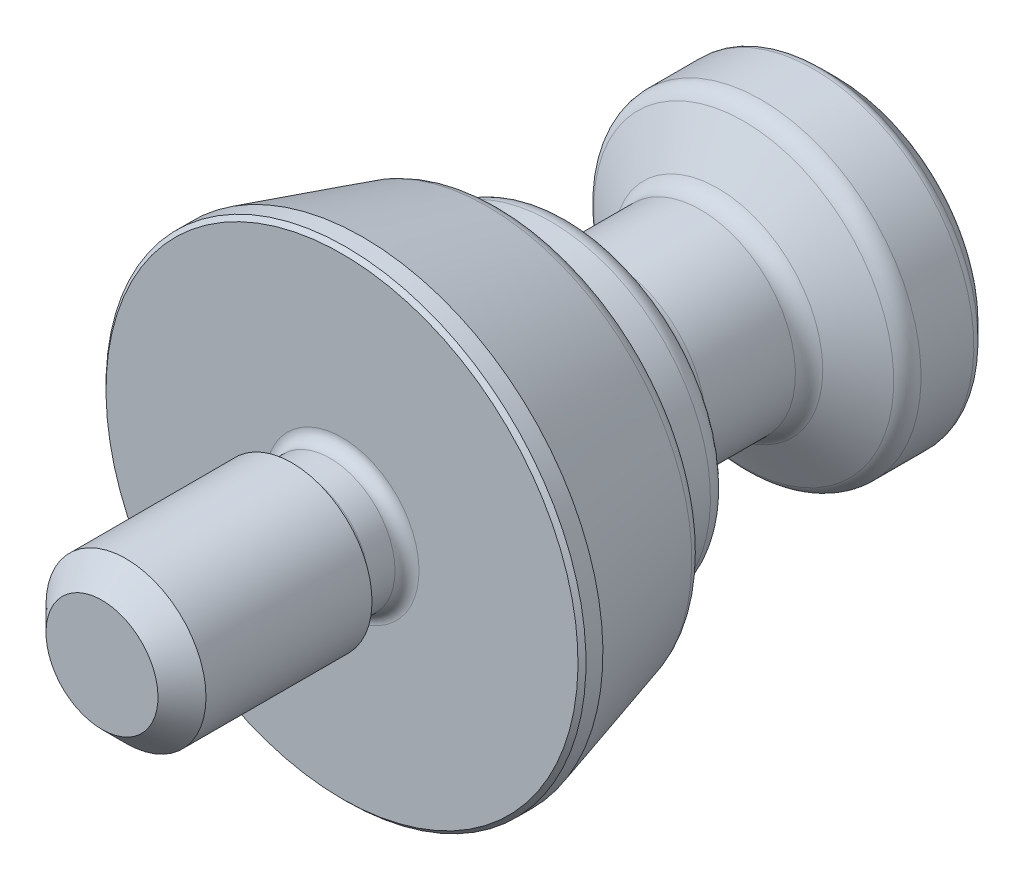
ISO-10303-21;
HEADER;
FILE_DESCRIPTION(('STEP AP214'),'2;1');
FILE_NAME('part.step','',(''),(''),'','','');
FILE_SCHEMA(('AUTOMOTIVE_DESIGN { 1 0 10303 214 1 1 1 1 }'));
ENDSEC;
DATA;
#1=APPLICATION_CONTEXT('core data for automotive mechanical design processes');
#2=APPLICATION_PROTOCOL_DEFINITION('international standard','automotive_design',2000,#1);
#3=PRODUCT_CONTEXT('',#1,'mechanical');
#4=PRODUCT('Part','Part','',(#3));
#5=PRODUCT_RELATED_PRODUCT_CATEGORY('part','',(#4));
#6=PRODUCT_DEFINITION_FORMATION('','',#4);
#7=PRODUCT_DEFINITION_CONTEXT('part definition',#1,'design');
#8=PRODUCT_DEFINITION('design','',#6,#7);
#9=PRODUCT_DEFINITION_SHAPE('','',#8);
#10=(LENGTH_UNIT() NAMED_UNIT(*) SI_UNIT(.MILLI.,.METRE.));
#11=(NAMED_UNIT(*) PLANE_ANGLE_UNIT() SI_UNIT($,.RADIAN.));
#12=(NAMED_UNIT(*) SI_UNIT($,.STERADIAN.) SOLID_ANGLE_UNIT());
#13=UNCERTAINTY_MEASURE_WITH_UNIT(LENGTH_MEASURE(1.E-05),#10,'distance_accuracy_value','');
#14=(GEOMETRIC_REPRESENTATION_CONTEXT(3) GLOBAL_UNCERTAINTY_ASSIGNED_CONTEXT((#13)) GLOBAL_UNIT_ASSIGNED_CONTEXT((#10,
#11,#12)) REPRESENTATION_CONTEXT('',''));
#15=CARTESIAN_POINT('',(0.,0.,0.));
#16=DIRECTION('',(0.,0.,1.));
#17=DIRECTION('',(1.,0.,0.));
#18=AXIS2_PLACEMENT_3D('',#15,#16,#17);
#19=CARTESIAN_POINT('',(2.88675134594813,0.,-21.5));
#20=DIRECTION('',(0.,0.,-1.));
#21=DIRECTION('',(0.,1.,0.));
#22=AXIS2_PLACEMENT_3D('',#19,#20,#21);
#23=PLANE('',#22);
#24=DIRECTION('',(-1.,0.,0.));
#25=VECTOR('',#24,1.);
#26=CARTESIAN_POINT('',(1.44337567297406,-2.5,-21.5));
#27=LINE('',#26,#25);
#28=CARTESIAN_POINT('',(1.44337567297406,-2.5,-21.5));
#29=VERTEX_POINT('',#28);
#30=CARTESIAN_POINT('',(0.,-2.5,-21.5));
#31=VERTEX_POINT('',#30);
#32=EDGE_CURVE('E216',#29,#31,#27,.T.);
#33=ORIENTED_EDGE('',*,*,#32,.T.);
#34=CARTESIAN_POINT('',(0.,0.,-21.5));
#35=DIRECTION('',(0.,0.,1.));
#36=DIRECTION('',(0.,-1.,0.));
#37=AXIS2_PLACEMENT_3D('',#34,#35,#36);
#38=CIRCLE('',#37,2.5);
#39=CARTESIAN_POINT('',(2.1650635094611,-1.25,-21.5));
#40=VERTEX_POINT('',#39);
#41=EDGE_CURVE('E29',#31,#40,#38,.T.);
#42=ORIENTED_EDGE('',*,*,#41,.T.);
#43=DIRECTION('',(-0.5,-0.866025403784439,0.));
#44=VECTOR('',#43,1.);
#45=CARTESIAN_POINT('',(2.88675134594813,0.,-21.5));
#46=LINE('',#45,#44);
#47=EDGE_CURVE('E440',#40,#29,#46,.T.);
#48=ORIENTED_EDGE('',*,*,#47,.T.);
#49=EDGE_LOOP('',(#33,#42,#48));
#50=FACE_BOUND('',#49,.T.);
#51=ADVANCED_FACE('F14',(#50),#23,.T.);
#52=CARTESIAN_POINT('',(2.88675134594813,0.,-21.5));
#53=VERTEX_POINT('',#52);
#54=EDGE_CURVE('E441',#53,#40,#46,.T.);
#55=ORIENTED_EDGE('',*,*,#54,.T.);
#56=CARTESIAN_POINT('',(2.1650635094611,1.25,-21.5));
#57=VERTEX_POINT('',#56);
#58=EDGE_CURVE('E103',#40,#57,#38,.T.);
#59=ORIENTED_EDGE('',*,*,#58,.T.);
#60=DIRECTION('',(0.5,-0.866025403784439,0.));
#61=VECTOR('',#60,1.);
#62=CARTESIAN_POINT('',(1.44337567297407,2.5,-21.5));
#63=LINE('',#62,#61);
#64=EDGE_CURVE('E436',#57,#53,#63,.T.);
#65=ORIENTED_EDGE('',*,*,#64,.T.);
#66=EDGE_LOOP('',(#55,#59,#65));
#67=FACE_BOUND('',#66,.T.);
#68=ADVANCED_FACE('F178',(#67),#23,.T.);
#69=CARTESIAN_POINT('',(1.44337567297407,2.5,-21.5));
#70=VERTEX_POINT('',#69);
#71=EDGE_CURVE('E437',#70,#57,#63,.T.);
#72=ORIENTED_EDGE('',*,*,#71,.T.);
#73=CARTESIAN_POINT('',(0.,2.5,-21.5));
#74=VERTEX_POINT('',#73);
#75=EDGE_CURVE('E461',#57,#74,#38,.T.);
#76=ORIENTED_EDGE('',*,*,#75,.T.);
#77=DIRECTION('',(1.,0.,0.));
#78=VECTOR('',#77,1.);
#79=CARTESIAN_POINT('',(-1.44337567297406,2.5,-21.5));
#80=LINE('',#79,#78);
#81=EDGE_CURVE('E221',#74,#70,#80,.T.);
#82=ORIENTED_EDGE('',*,*,#81,.T.);
#83=EDGE_LOOP('',(#72,#76,#82));
#84=FACE_BOUND('',#83,.T.);
#85=ADVANCED_FACE('F185',(#84),#23,.T.);
#86=CARTESIAN_POINT('',(-1.44337567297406,2.5,-21.5));
#87=VERTEX_POINT('',#86);
#88=EDGE_CURVE('E222',#87,#74,#80,.T.);
#89=ORIENTED_EDGE('',*,*,#88,.T.);
#90=CARTESIAN_POINT('',(-2.1650635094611,1.25,-21.5));
#91=VERTEX_POINT('',#90);
#92=EDGE_CURVE('E460',#74,#91,#38,.T.);
#93=ORIENTED_EDGE('',*,*,#92,.T.);
#94=DIRECTION('',(0.5,0.866025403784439,0.));
#95=VECTOR('',#94,1.);
#96=CARTESIAN_POINT('',(-2.88675134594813,0.,-21.5));
#97=LINE('',#96,#95);
#98=EDGE_CURVE('E211',#91,#87,#97,.T.);
#99=ORIENTED_EDGE('',*,*,#98,.T.);
#100=EDGE_LOOP('',(#89,#93,#99));
#101=FACE_BOUND('',#100,.T.);
#102=ADVANCED_FACE('F200',(#101),#23,.T.);
#103=CARTESIAN_POINT('',(-2.88675134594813,0.,-21.5));
#104=VERTEX_POINT('',#103);
#105=EDGE_CURVE('E214',#104,#91,#97,.T.);
#106=ORIENTED_EDGE('',*,*,#105,.T.);
#107=CARTESIAN_POINT('',(-2.1650635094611,-1.25,-21.5));
#108=VERTEX_POINT('',#107);
#109=EDGE_CURVE('E458',#91,#108,#38,.T.);
#110=ORIENTED_EDGE('',*,*,#109,.T.);
#111=DIRECTION('',(-0.5,0.866025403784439,0.));
#112=VECTOR('',#111,1.);
#113=CARTESIAN_POINT('',(-1.44337567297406,-2.5,-21.5));
#114=LINE('',#113,#112);
#115=EDGE_CURVE('E212',#108,#104,#114,.T.);
#116=ORIENTED_EDGE('',*,*,#115,.T.);
#117=EDGE_LOOP('',(#106,#110,#116));
#118=FACE_BOUND('',#117,.T.);
#119=ADVANCED_FACE('F191',(#118),#23,.T.);
#120=CARTESIAN_POINT('',(-1.44337567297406,-2.5,-21.5));
#121=VERTEX_POINT('',#120);
#122=EDGE_CURVE('E204',#121,#108,#114,.T.);
#123=ORIENTED_EDGE('',*,*,#122,.T.);
#124=EDGE_CURVE('E104',#108,#31,#38,.T.);
#125=ORIENTED_EDGE('',*,*,#124,.T.);
#126=EDGE_CURVE('E206',#31,#121,#27,.T.);
#127=ORIENTED_EDGE('',*,*,#126,.T.);
#128=EDGE_LOOP('',(#123,#125,#127));
#129=FACE_BOUND('',#128,.T.);
#130=ADVANCED_FACE('F181',(#129),#23,.T.);
#131=CARTESIAN_POINT('',(8.0005,0.,-25.));
#132=DIRECTION('',(0.,0.,-1.));
#133=DIRECTION('',(0.,1.,0.));
#134=AXIS2_PLACEMENT_3D('',#131,#132,#133);
#135=PLANE('',#134);
#136=CARTESIAN_POINT('',(0.,0.,-25.));
#137=DIRECTION('',(0.,0.,-1.));
#138=DIRECTION('',(0.,1.,0.));
#139=AXIS2_PLACEMENT_3D('',#136,#137,#138);
#140=CIRCLE('',#139,6.38578643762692);
#141=CARTESIAN_POINT('',(0.,6.38578643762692,-25.));
#142=VERTEX_POINT('',#141);
#143=EDGE_CURVE('E269',#142,#142,#140,.T.);
#144=ORIENTED_EDGE('',*,*,#143,.T.);
#145=EDGE_LOOP('',(#144));
#146=FACE_BOUND('',#145,.T.);
#147=CARTESIAN_POINT('',(0.,0.,-25.));
#148=DIRECTION('',(0.,0.,1.));
#149=DIRECTION('',(0.,-1.,0.));
#150=AXIS2_PLACEMENT_3D('',#147,#148,#149);
#151=CIRCLE('',#150,3.2);
#152=CARTESIAN_POINT('',(0.,-3.2,-25.));
#153=VERTEX_POINT('',#152);
#154=EDGE_CURVE('E96',#153,#153,#151,.T.);
#155=ORIENTED_EDGE('',*,*,#154,.T.);
#156=EDGE_LOOP('',(#155));
#157=FACE_BOUND('',#156,.T.);
#158=ADVANCED_FACE('F190',(#146,#157),#135,.T.);
#159=CARTESIAN_POINT('',(0.,0.,0.));
#160=DIRECTION('',(0.,0.,1.));
#161=DIRECTION('',(0.,-1.,0.));
#162=AXIS2_PLACEMENT_3D('',#159,#160,#161);
#163=CYLINDRICAL_SURFACE('',#162,8.);
#164=CARTESIAN_POINT('',(0.,0.,-20.9537386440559));
#165=DIRECTION('',(0.,0.,-1.));
#166=DIRECTION('',(0.,1.,0.));
#167=AXIS2_PLACEMENT_3D('',#164,#165,#166);
#168=CIRCLE('',#167,8.);
#169=CARTESIAN_POINT('',(0.,8.,-20.9537386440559));
#170=VERTEX_POINT('',#169);
#171=EDGE_CURVE('E293',#170,#170,#168,.T.);
#172=ORIENTED_EDGE('',*,*,#171,.T.);
#173=EDGE_LOOP('',(#172));
#174=FACE_BOUND('',#173,.T.);
#175=CARTESIAN_POINT('',(0.,0.,-23.5928932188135));
#176=DIRECTION('',(0.,0.,-1.));
#177=DIRECTION('',(0.,1.,0.));
#178=AXIS2_PLACEMENT_3D('',#175,#176,#177);
#179=CIRCLE('',#178,8.);
#180=CARTESIAN_POINT('',(0.,8.,-23.5928932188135));
#181=VERTEX_POINT('',#180);
#182=EDGE_CURVE('E254',#181,#181,#179,.F.);
#183=ORIENTED_EDGE('',*,*,#182,.T.);
#184=EDGE_LOOP('',(#183));
#185=FACE_BOUND('',#184,.T.);
#186=ADVANCED_FACE('F197',(#174,#185),#163,.T.);
#187=CARTESIAN_POINT('',(0.,0.,0.));
#188=DIRECTION('',(0.,0.,-1.));
#189=DIRECTION('',(0.,1.,0.));
#190=AXIS2_PLACEMENT_3D('',#187,#188,#189);
#191=CYLINDRICAL_SURFACE('',#190,8.0005);
#192=CARTESIAN_POINT('',(0.,0.,-8.4));
#193=DIRECTION('',(0.,0.,-1.));
#194=DIRECTION('',(0.,1.,0.));
#195=AXIS2_PLACEMENT_3D('',#192,#193,#194);
#196=CIRCLE('',#195,8.0005);
#197=CARTESIAN_POINT('',(0.,8.0005,-8.4));
#198=VERTEX_POINT('',#197);
#199=EDGE_CURVE('E9',#198,#198,#196,.T.);
#200=ORIENTED_EDGE('',*,*,#199,.T.);
#201=EDGE_LOOP('',(#200));
#202=FACE_BOUND('',#201,.T.);
#203=CARTESIAN_POINT('',(0.,0.,-10.4226497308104));
#204=DIRECTION('',(0.,0.,-1.));
#205=DIRECTION('',(0.,1.,0.));
#206=AXIS2_PLACEMENT_3D('',#203,#204,#205);
#207=CIRCLE('',#206,8.0005);
#208=CARTESIAN_POINT('',(0.,8.0005,-10.4226497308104));
#209=VERTEX_POINT('',#208);
#210=EDGE_CURVE('E284',#209,#209,#207,.F.);
#211=ORIENTED_EDGE('',*,*,#210,.T.);
#212=EDGE_LOOP('',(#211));
#213=FACE_BOUND('',#212,.T.);
#214=ADVANCED_FACE('F323',(#202,#213),#191,.T.);
#215=CARTESIAN_POINT('',(0.,0.,0.));
#216=DIRECTION('',(0.,0.,1.));
#217=DIRECTION('',(0.,-1.,0.));
#218=AXIS2_PLACEMENT_3D('',#215,#216,#217);
#219=CYLINDRICAL_SURFACE('',#218,4.75);
#220=CARTESIAN_POINT('',(0.,0.,-17.9226497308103));
#221=DIRECTION('',(0.,0.,1.));
#222=DIRECTION('',(0.,-1.,0.));
#223=AXIS2_PLACEMENT_3D('',#220,#221,#222);
#224=CIRCLE('',#223,4.75);
#225=CARTESIAN_POINT('',(0.,-4.75,-17.9226497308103));
#226=VERTEX_POINT('',#225);
#227=EDGE_CURVE('E245',#226,#226,#224,.T.);
#228=ORIENTED_EDGE('',*,*,#227,.T.);
#229=EDGE_LOOP('',(#228));
#230=FACE_BOUND('',#229,.T.);
#231=CARTESIAN_POINT('',(0.,0.,-13.4540273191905));
#232=DIRECTION('',(0.,0.,1.));
#233=DIRECTION('',(0.,-1.,0.));
#234=AXIS2_PLACEMENT_3D('',#231,#232,#233);
#235=CIRCLE('',#234,4.75);
#236=CARTESIAN_POINT('',(0.,-4.75,-13.4540273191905));
#237=VERTEX_POINT('',#236);
#238=EDGE_CURVE('E229',#237,#237,#235,.F.);
#239=ORIENTED_EDGE('',*,*,#238,.T.);
#240=EDGE_LOOP('',(#239));
#241=FACE_BOUND('',#240,.T.);
#242=ADVANCED_FACE('F326',(#230,#241),#219,.T.);
#243=CARTESIAN_POINT('',(0.,0.,-18.5));
#244=DIRECTION('',(0.,0.,-1.));
#245=DIRECTION('',(0.,1.,0.));
#246=AXIS2_PLACEMENT_3D('',#243,#244,#245);
#247=CONICAL_SURFACE('',#246,4.75,1.0471975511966);
#248=CARTESIAN_POINT('',(0.,0.,-20.0877132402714));
#249=DIRECTION('',(0.,0.,1.));
#250=DIRECTION('',(0.,-1.,0.));
#251=AXIS2_PLACEMENT_3D('',#248,#249,#250);
#252=CIRCLE('',#251,7.5);
#253=CARTESIAN_POINT('',(0.,-7.5,-20.0877132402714));
#254=VERTEX_POINT('',#253);
#255=EDGE_CURVE('E290',#254,#254,#252,.T.);
#256=ORIENTED_EDGE('',*,*,#255,.T.);
#257=EDGE_LOOP('',(#256));
#258=FACE_BOUND('',#257,.T.);
#259=CARTESIAN_POINT('',(0.,0.,-18.7886751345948));
#260=DIRECTION('',(0.,0.,-1.));
#261=DIRECTION('',(0.,1.,0.));
#262=AXIS2_PLACEMENT_3D('',#259,#260,#261);
#263=CIRCLE('',#262,5.25);
#264=CARTESIAN_POINT('',(0.,5.25,-18.7886751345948));
#265=VERTEX_POINT('',#264);
#266=EDGE_CURVE('E248',#265,#265,#263,.T.);
#267=ORIENTED_EDGE('',*,*,#266,.T.);
#268=EDGE_LOOP('',(#267));
#269=FACE_BOUND('',#268,.T.);
#270=ADVANCED_FACE('F539',(#258,#269),#247,.T.);
#271=CARTESIAN_POINT('',(0.,0.,-11.));
#272=DIRECTION('',(0.,0.,1.));
#273=DIRECTION('',(0.,-1.,0.));
#274=AXIS2_PLACEMENT_3D('',#271,#272,#273);
#275=CONICAL_SURFACE('',#274,8.0005,1.0471975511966);
#276=CARTESIAN_POINT('',(0.,0.,-11.2886751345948));
#277=DIRECTION('',(0.,0.,-1.));
#278=DIRECTION('',(0.,1.,0.));
#279=AXIS2_PLACEMENT_3D('',#276,#277,#278);
#280=CIRCLE('',#279,7.5005);
#281=CARTESIAN_POINT('',(0.,7.5005,-11.2886751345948));
#282=VERTEX_POINT('',#281);
#283=EDGE_CURVE('E287',#282,#282,#280,.T.);
#284=ORIENTED_EDGE('',*,*,#283,.T.);
#285=EDGE_LOOP('',(#284));
#286=FACE_BOUND('',#285,.T.);
#287=CARTESIAN_POINT('',(0.,0.,-12.5880019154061));
#288=DIRECTION('',(0.,0.,1.));
#289=DIRECTION('',(0.,-1.,0.));
#290=AXIS2_PLACEMENT_3D('',#287,#288,#289);
#291=CIRCLE('',#290,5.25);
#292=CARTESIAN_POINT('',(0.,-5.25,-12.5880019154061));
#293=VERTEX_POINT('',#292);
#294=EDGE_CURVE('E251',#293,#293,#291,.T.);
#295=ORIENTED_EDGE('',*,*,#294,.T.);
#296=EDGE_LOOP('',(#295));
#297=FACE_BOUND('',#296,.T.);
#298=ADVANCED_FACE('F547',(#286,#297),#275,.T.);
#299=CARTESIAN_POINT('',(0.,0.,-23.8));
#300=DIRECTION('',(0.,0.,1.));
#301=DIRECTION('',(0.,-1.,0.));
#302=AXIS2_PLACEMENT_3D('',#299,#300,#301);
#303=CONICAL_SURFACE('',#302,8.,0.785398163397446);
#304=CARTESIAN_POINT('',(0.,0.,-24.7071067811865));
#305=DIRECTION('',(0.,0.,-1.));
#306=DIRECTION('',(0.,1.,0.));
#307=AXIS2_PLACEMENT_3D('',#304,#305,#306);
#308=CIRCLE('',#307,7.09289321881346);
#309=CARTESIAN_POINT('',(0.,7.09289321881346,-24.7071067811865));
#310=VERTEX_POINT('',#309);
#311=EDGE_CURVE('E266',#310,#310,#308,.F.);
#312=ORIENTED_EDGE('',*,*,#311,.T.);
#313=EDGE_LOOP('',(#312));
#314=FACE_BOUND('',#313,.T.);
#315=CARTESIAN_POINT('',(0.,0.,-23.9464466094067));
#316=DIRECTION('',(0.,0.,-1.));
#317=DIRECTION('',(0.,1.,0.));
#318=AXIS2_PLACEMENT_3D('',#315,#316,#317);
#319=CIRCLE('',#318,7.85355339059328);
#320=CARTESIAN_POINT('',(0.,7.85355339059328,-23.9464466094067));
#321=VERTEX_POINT('',#320);
#322=EDGE_CURVE('E257',#321,#321,#319,.T.);
#323=ORIENTED_EDGE('',*,*,#322,.T.);
#324=EDGE_LOOP('',(#323));
#325=FACE_BOUND('',#324,.T.);
#326=ADVANCED_FACE('F401',(#314,#325),#303,.T.);
#327=CARTESIAN_POINT('',(0.,0.,-17.9226497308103));
#328=DIRECTION('',(0.,0.,1.));
#329=DIRECTION('',(0.,-1.,0.));
#330=AXIS2_PLACEMENT_3D('',#327,#328,#329);
#331=TOROIDAL_SURFACE('',#330,5.75,1.);
#332=ORIENTED_EDGE('',*,*,#266,.F.);
#333=EDGE_LOOP('',(#332));
#334=FACE_BOUND('',#333,.T.);
#335=ORIENTED_EDGE('',*,*,#227,.F.);
#336=EDGE_LOOP('',(#335));
#337=FACE_BOUND('',#336,.T.);
#338=ADVANCED_FACE('F397',(#334,#337),#331,.F.);
#339=CARTESIAN_POINT('',(0.,0.,-13.4540273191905));
#340=DIRECTION('',(0.,0.,1.));
#341=DIRECTION('',(0.,-1.,0.));
#342=AXIS2_PLACEMENT_3D('',#339,#340,#341);
#343=TOROIDAL_SURFACE('',#342,5.75,1.);
#344=ORIENTED_EDGE('',*,*,#238,.F.);
#345=EDGE_LOOP('',(#344));
#346=FACE_BOUND('',#345,.T.);
#347=ORIENTED_EDGE('',*,*,#294,.F.);
#348=EDGE_LOOP('',(#347));
#349=FACE_BOUND('',#348,.T.);
#350=ADVANCED_FACE('F400',(#346,#349),#343,.F.);
#351=CARTESIAN_POINT('',(0.,0.,-23.5928932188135));
#352=DIRECTION('',(0.,0.,-1.));
#353=DIRECTION('',(0.,1.,0.));
#354=AXIS2_PLACEMENT_3D('',#351,#352,#353);
#355=TOROIDAL_SURFACE('',#354,7.5,0.5);
#356=ORIENTED_EDGE('',*,*,#322,.F.);
#357=EDGE_LOOP('',(#356));
#358=FACE_BOUND('',#357,.T.);
#359=ORIENTED_EDGE('',*,*,#182,.F.);
#360=EDGE_LOOP('',(#359));
#361=FACE_BOUND('',#360,.T.);
#362=ADVANCED_FACE('F405',(#358,#361),#355,.T.);
#363=CARTESIAN_POINT('',(0.,0.,-24.));
#364=DIRECTION('',(0.,0.,-1.));
#365=DIRECTION('',(0.,1.,0.));
#366=AXIS2_PLACEMENT_3D('',#363,#364,#365);
#367=TOROIDAL_SURFACE('',#366,6.38578643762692,1.);
#368=ORIENTED_EDGE('',*,*,#143,.F.);
#369=EDGE_LOOP('',(#368));
#370=FACE_BOUND('',#369,.T.);
#371=ORIENTED_EDGE('',*,*,#311,.F.);
#372=EDGE_LOOP('',(#371));
#373=FACE_BOUND('',#372,.T.);
#374=ADVANCED_FACE('F129',(#370,#373),#367,.T.);
#375=CARTESIAN_POINT('',(0.,0.,-25.));
#376=DIRECTION('',(0.,0.,-1.));
#377=DIRECTION('',(0.,1.,0.));
#378=AXIS2_PLACEMENT_3D('',#375,#376,#377);
#379=CONICAL_SURFACE('',#378,3.2,1.0471975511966);
#380=ORIENTED_EDGE('',*,*,#154,.F.);
#381=EDGE_LOOP('',(#380));
#382=FACE_BOUND('',#381,.T.);
#383=CARTESIAN_POINT('',(1.44326020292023,-2.5002,-24.8192124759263));
#384=CARTESIAN_POINT('',(1.50668977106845,-2.39033676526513,-24.7825764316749));
#385=CARTESIAN_POINT('',(1.57066685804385,-2.27952520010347,-24.7492570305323));
#386=CARTESIAN_POINT('',(1.69972891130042,-2.05598316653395,-24.6910970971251));
#387=CARTESIAN_POINT('',(1.7648161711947,-1.94324872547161,-24.666277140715));
#388=CARTESIAN_POINT('',(1.8941840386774,-1.71917700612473,-24.6276404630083));
#389=CARTESIAN_POINT('',(1.95844473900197,-1.60787420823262,-24.6135666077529));
#390=CARTESIAN_POINT('',(2.08726857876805,-1.38474477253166,-24.59676396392));
#391=CARTESIAN_POINT('',(2.15183124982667,-1.27291894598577,-24.5940212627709));
#392=CARTESIAN_POINT('',(2.27247489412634,-1.06395802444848,-24.5997205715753));
#393=CARTESIAN_POINT('',(2.32857390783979,-0.96679168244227,-24.6067632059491));
#394=CARTESIAN_POINT('',(2.44040644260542,-0.773092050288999,-24.6290862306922));
#395=CARTESIAN_POINT('',(2.49613957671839,-0.676559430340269,-24.6443742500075));
#396=CARTESIAN_POINT('',(2.60820277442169,-0.482460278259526,-24.6825939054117));
#397=CARTESIAN_POINT('',(2.66451865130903,-0.384918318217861,-24.7056875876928));
#398=CARTESIAN_POINT('',(2.77631036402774,-0.191289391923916,-24.7581014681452));
#399=CARTESIAN_POINT('',(2.83178763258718,-0.0951999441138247,-24.7874093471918));
#400=CARTESIAN_POINT('',(2.88686681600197,0.000200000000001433,-24.8192124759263));
#401=B_SPLINE_CURVE_WITH_KNOTS('',3,(#383,#384,#385,#386,#387,#388,#389,#390,#391,#392,#393,
#394,#395,#396,#397,#398,#399,#400),.UNSPECIFIED.,.F.,.F.,(4,2,2,2,2,2,2,2,4),(0.,
0.396285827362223,0.793524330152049,1.18093086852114,1.56786160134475,1.90479741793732,
2.24204551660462,2.58677531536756,2.93082800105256),.UNSPECIFIED.);
#402=CARTESIAN_POINT('',(1.44337567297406,-2.5,-24.8191458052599));
#403=VERTEX_POINT('',#402);
#404=CARTESIAN_POINT('',(2.88675134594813,0.,-24.8191458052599));
#405=VERTEX_POINT('',#404);
#406=EDGE_CURVE('E37',#403,#405,#401,.T.);
#407=ORIENTED_EDGE('',*,*,#406,.T.);
#408=CARTESIAN_POINT('',(2.88686681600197,-0.000199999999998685,-24.8192124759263));
#409=CARTESIAN_POINT('',(2.82343724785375,0.109663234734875,-24.7825764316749));
#410=CARTESIAN_POINT('',(2.75946016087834,0.220474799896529,-24.7492570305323));
#411=CARTESIAN_POINT('',(2.63039810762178,0.444016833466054,-24.6910970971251));
#412=CARTESIAN_POINT('',(2.5653108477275,0.556751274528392,-24.666277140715));
#413=CARTESIAN_POINT('',(2.43594298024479,0.780822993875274,-24.6276404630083));
#414=CARTESIAN_POINT('',(2.37168227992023,0.892125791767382,-24.6135666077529));
#415=CARTESIAN_POINT('',(2.24285844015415,1.11525522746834,-24.59676396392));
#416=CARTESIAN_POINT('',(2.17829576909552,1.22708105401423,-24.5940212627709));
#417=CARTESIAN_POINT('',(2.05765212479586,1.43604197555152,-24.5997205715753));
#418=CARTESIAN_POINT('',(2.0015531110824,1.53320831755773,-24.6067632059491));
#419=CARTESIAN_POINT('',(1.88972057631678,1.726907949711,-24.6290862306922));
#420=CARTESIAN_POINT('',(1.8339874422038,1.82344056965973,-24.6443742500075));
#421=CARTESIAN_POINT('',(1.72192424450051,2.01753972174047,-24.6825939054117));
#422=CARTESIAN_POINT('',(1.66560836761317,2.11508168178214,-24.7056875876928));
#423=CARTESIAN_POINT('',(1.55381665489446,2.30871060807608,-24.7581014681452));
#424=CARTESIAN_POINT('',(1.49833938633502,2.40480005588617,-24.7874093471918));
#425=CARTESIAN_POINT('',(1.44326020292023,2.5002,-24.8192124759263));
#426=B_SPLINE_CURVE_WITH_KNOTS('',3,(#408,#409,#410,#411,#412,#413,#414,#415,#416,#417,#418,
#419,#420,#421,#422,#423,#424,#425),.UNSPECIFIED.,.F.,.F.,(4,2,2,2,2,2,2,2,4),(0.,
0.396285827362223,0.793524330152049,1.18093086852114,1.56786160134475,1.90479741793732,
2.24204551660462,2.58677531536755,2.93082800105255),.UNSPECIFIED.);
#427=CARTESIAN_POINT('',(1.44337567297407,2.5,-24.8191458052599));
#428=VERTEX_POINT('',#427);
#429=EDGE_CURVE('E99',#405,#428,#426,.T.);
#430=ORIENTED_EDGE('',*,*,#429,.T.);
#431=CARTESIAN_POINT('',(-3.77372348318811,2.5,-25.7659690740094));
#432=CARTESIAN_POINT('',(-3.66532713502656,2.5,-25.7138116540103));
#433=CARTESIAN_POINT('',(-3.5566704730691,2.5,-25.6621853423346));
#434=CARTESIAN_POINT('',(-3.33869759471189,2.5,-25.5602960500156));
#435=CARTESIAN_POINT('',(-3.22938126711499,2.5,-25.5100333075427));
#436=CARTESIAN_POINT('',(-3.00933576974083,2.5,-25.4108968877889));
#437=CARTESIAN_POINT('',(-2.89860206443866,2.5,-25.3620332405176));
#438=CARTESIAN_POINT('',(-2.67621651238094,2.5,-25.2664499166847));
#439=CARTESIAN_POINT('',(-2.56456471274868,2.5,-25.2197301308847));
#440=CARTESIAN_POINT('',(-2.33704252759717,2.5,-25.1277417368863));
#441=CARTESIAN_POINT('',(-2.22114109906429,2.5,-25.082549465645));
#442=CARTESIAN_POINT('',(-1.98794483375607,2.5,-24.9958424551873));
#443=CARTESIAN_POINT('',(-1.87064983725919,2.5,-24.9543281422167));
#444=CARTESIAN_POINT('',(-1.63473483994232,2.5,-24.8761429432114));
#445=CARTESIAN_POINT('',(-1.51611844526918,2.5,-24.8394612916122));
#446=CARTESIAN_POINT('',(-1.27718906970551,2.5,-24.7721855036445));
#447=CARTESIAN_POINT('',(-1.15687666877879,2.5,-24.7415893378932));
#448=CARTESIAN_POINT('',(-0.915104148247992,2.5,-24.6881678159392));
#449=CARTESIAN_POINT('',(-0.793652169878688,2.5,-24.6653063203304));
#450=CARTESIAN_POINT('',(-0.549353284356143,2.5,-24.628724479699));
#451=CARTESIAN_POINT('',(-0.426506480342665,2.5,-24.6150034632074));
#452=CARTESIAN_POINT('',(-0.181589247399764,2.5,-24.5979769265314));
#453=CARTESIAN_POINT('',(-0.0595277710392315,2.5,-24.5945457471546));
#454=CARTESIAN_POINT('',(0.18445324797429,2.5,-24.5980647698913));
#455=CARTESIAN_POINT('',(0.306372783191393,2.5,-24.6050154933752));
#456=CARTESIAN_POINT('',(0.516525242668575,2.5,-24.6254710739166));
#457=CARTESIAN_POINT('',(0.604990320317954,2.5,-24.636707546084));
#458=CARTESIAN_POINT('',(0.781201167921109,2.5,-24.6638879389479));
#459=CARTESIAN_POINT('',(0.868946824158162,2.5,-24.6798325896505));
#460=CARTESIAN_POINT('',(1.13101461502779,2.5,-24.73388535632));
#461=CARTESIAN_POINT('',(1.30405772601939,2.5,-24.7782002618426));
#462=CARTESIAN_POINT('',(1.65032858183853,2.5,-24.879785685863));
#463=CARTESIAN_POINT('',(1.82347546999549,2.5,-24.9373214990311));
#464=CARTESIAN_POINT('',(2.08081862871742,2.5,-25.0300094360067));
#465=CARTESIAN_POINT('',(2.16619199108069,2.5,-25.0619646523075));
#466=CARTESIAN_POINT('',(2.33624768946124,2.5,-25.1276627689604));
#467=CARTESIAN_POINT('',(2.42093003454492,2.5,-25.1614056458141));
#468=CARTESIAN_POINT('',(2.62603474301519,2.5,-25.2452265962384));
#469=CARTESIAN_POINT('',(2.74613938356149,2.5,-25.2960801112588));
#470=CARTESIAN_POINT('',(2.9853252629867,2.5,-25.4001455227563));
#471=CARTESIAN_POINT('',(3.10440644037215,2.5,-25.4533575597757));
#472=CARTESIAN_POINT('',(3.46043992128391,2.5,-25.6157641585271));
#473=CARTESIAN_POINT('',(3.69613537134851,2.5,-25.7277095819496));
#474=CARTESIAN_POINT('',(4.16548797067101,2.5,-25.9563787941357));
#475=CARTESIAN_POINT('',(4.39914263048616,2.5,-26.0731076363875));
#476=CARTESIAN_POINT('',(4.86481739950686,2.5,-26.3097054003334));
#477=CARTESIAN_POINT('',(5.09683770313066,2.5,-26.4295739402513));
#478=CARTESIAN_POINT('',(5.5396497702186,2.5,-26.6610256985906));
#479=CARTESIAN_POINT('',(5.75053751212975,2.5,-26.7724259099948));
#480=CARTESIAN_POINT('',(6.17158854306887,2.5,-26.9966038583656));
#481=CARTESIAN_POINT('',(6.38175180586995,2.5,-27.109381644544));
#482=CARTESIAN_POINT('',(6.80101584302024,2.5,-27.3357110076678));
#483=CARTESIAN_POINT('',(7.01011795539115,2.5,-27.4492601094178));
#484=CARTESIAN_POINT('',(7.42786313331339,2.5,-27.6771738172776));
#485=CARTESIAN_POINT('',(7.63650622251,2.5,-27.7915383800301));
#486=CARTESIAN_POINT('',(7.84498187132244,2.5,-27.9062054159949));
#487=B_SPLINE_CURVE_WITH_KNOTS('',3,(#431,#432,#433,#434,#435,#436,#437,#438,#439,#440,#441,
#442,#443,#444,#445,#446,#447,#448,#449,#450,#451,#452,#453,#454,#455,#456,#457,#458,#459,#460,
#461,#462,#463,#464,#465,#466,#467,#468,#469,#470,#471,#472,#473,#474,#475,#476,#477,#478,#479,
#480,#481,#482,#483,#484,#485,#486),.UNSPECIFIED.,.F.,.F.,(4,2,2,2,2,2,2,2,2,2,2,2,2,2,2,2,2,2,
2,2,2,2,2,2,2,2,2,4),(0.,0.360880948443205,0.721824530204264,1.08491311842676,1.44798318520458,
1.8211364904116,2.19433298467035,2.56668353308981,2.93890970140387,3.30937185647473,
3.6798067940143,4.04569918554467,4.41160995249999,4.67900678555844,4.94644510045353,
5.48165172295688,6.02871656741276,6.30217432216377,6.57562848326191,6.96687524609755,
7.35814535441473,8.14083774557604,8.92437948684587,9.70782639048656,10.4233292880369,
11.1388578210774,11.8526862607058,12.5664770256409),.UNSPECIFIED.);
#488=CARTESIAN_POINT('',(-1.44337567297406,2.5,-24.8191458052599));
#489=VERTEX_POINT('',#488);
#490=EDGE_CURVE('E114',#428,#489,#487,.F.);
#491=ORIENTED_EDGE('',*,*,#490,.T.);
#492=CARTESIAN_POINT('',(-1.44326020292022,2.5002,-24.8192124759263));
#493=CARTESIAN_POINT('',(-1.50668977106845,2.39033676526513,-24.7825764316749));
#494=CARTESIAN_POINT('',(-1.57066685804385,2.27952520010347,-24.7492570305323));
#495=CARTESIAN_POINT('',(-1.69972891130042,2.05598316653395,-24.6910970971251));
#496=CARTESIAN_POINT('',(-1.7648161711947,1.94324872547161,-24.666277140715));
#497=CARTESIAN_POINT('',(-1.8941840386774,1.71917700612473,-24.6276404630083));
#498=CARTESIAN_POINT('',(-1.95844473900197,1.60787420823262,-24.6135666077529));
#499=CARTESIAN_POINT('',(-2.08726857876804,1.38474477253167,-24.59676396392));
#500=CARTESIAN_POINT('',(-2.15183124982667,1.27291894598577,-24.5940212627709));
#501=CARTESIAN_POINT('',(-2.27247489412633,1.06395802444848,-24.5997205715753));
#502=CARTESIAN_POINT('',(-2.32857390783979,0.966791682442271,-24.6067632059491));
#503=CARTESIAN_POINT('',(-2.44040644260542,0.773092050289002,-24.6290862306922));
#504=CARTESIAN_POINT('',(-2.49613957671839,0.676559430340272,-24.6443742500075));
#505=CARTESIAN_POINT('',(-2.60820277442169,0.482460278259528,-24.6825939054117));
#506=CARTESIAN_POINT('',(-2.66451865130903,0.384918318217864,-24.7056875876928));
#507=CARTESIAN_POINT('',(-2.77631036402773,0.191289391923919,-24.7581014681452));
#508=CARTESIAN_POINT('',(-2.83178763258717,0.0951999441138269,-24.7874093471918));
#509=CARTESIAN_POINT('',(-2.88686681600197,-0.000200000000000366,-24.8192124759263));
#510=B_SPLINE_CURVE_WITH_KNOTS('',3,(#492,#493,#494,#495,#496,#497,#498,#499,#500,#501,#502,
#503,#504,#505,#506,#507,#508,#509),.UNSPECIFIED.,.F.,.F.,(4,2,2,2,2,2,2,2,4),(0.,
0.396285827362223,0.793524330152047,1.18093086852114,1.56786160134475,1.90479741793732,
2.24204551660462,2.58677531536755,2.93082800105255),.UNSPECIFIED.);
#511=CARTESIAN_POINT('',(-2.88675134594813,0.,-24.8191458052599));
#512=VERTEX_POINT('',#511);
#513=EDGE_CURVE('E140',#489,#512,#510,.T.);
#514=ORIENTED_EDGE('',*,*,#513,.T.);
#515=CARTESIAN_POINT('',(-2.88686681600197,0.00019999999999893,-24.8192124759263));
#516=CARTESIAN_POINT('',(-2.82343724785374,-0.109663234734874,-24.7825764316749));
#517=CARTESIAN_POINT('',(-2.75946016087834,-0.220474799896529,-24.7492570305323));
#518=CARTESIAN_POINT('',(-2.63039810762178,-0.444016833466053,-24.6910970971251));
#519=CARTESIAN_POINT('',(-2.56531084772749,-0.556751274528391,-24.666277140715));
#520=CARTESIAN_POINT('',(-2.43594298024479,-0.780822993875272,-24.6276404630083));
#521=CARTESIAN_POINT('',(-2.37168227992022,-0.89212579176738,-24.6135666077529));
#522=CARTESIAN_POINT('',(-2.24285844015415,-1.11525522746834,-24.59676396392));
#523=CARTESIAN_POINT('',(-2.17829576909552,-1.22708105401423,-24.5940212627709));
#524=CARTESIAN_POINT('',(-2.05765212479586,-1.43604197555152,-24.5997205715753));
#525=CARTESIAN_POINT('',(-2.0015531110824,-1.53320831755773,-24.6067632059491));
#526=CARTESIAN_POINT('',(-1.88972057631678,-1.726907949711,-24.6290862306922));
#527=CARTESIAN_POINT('',(-1.8339874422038,-1.82344056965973,-24.6443742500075));
#528=CARTESIAN_POINT('',(-1.7219242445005,-2.01753972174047,-24.6825939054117));
#529=CARTESIAN_POINT('',(-1.66560836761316,-2.11508168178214,-24.7056875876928));
#530=CARTESIAN_POINT('',(-1.55381665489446,-2.30871060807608,-24.7581014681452));
#531=CARTESIAN_POINT('',(-1.49833938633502,-2.40480005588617,-24.7874093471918));
#532=CARTESIAN_POINT('',(-1.44326020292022,-2.5002,-24.8192124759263));
#533=B_SPLINE_CURVE_WITH_KNOTS('',3,(#515,#516,#517,#518,#519,#520,#521,#522,#523,#524,#525,
#526,#527,#528,#529,#530,#531,#532),.UNSPECIFIED.,.F.,.F.,(4,2,2,2,2,2,2,2,4),(0.,
0.396285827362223,0.793524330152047,1.18093086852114,1.56786160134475,1.90479741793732,
2.24204551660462,2.58677531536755,2.93082800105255),.UNSPECIFIED.);
#534=CARTESIAN_POINT('',(-1.44337567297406,-2.5,-24.8191458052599));
#535=VERTEX_POINT('',#534);
#536=EDGE_CURVE('E147',#512,#535,#533,.T.);
#537=ORIENTED_EDGE('',*,*,#536,.T.);
#538=CARTESIAN_POINT('',(-3.77372348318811,-2.5,-25.7659690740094));
#539=CARTESIAN_POINT('',(-3.66532713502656,-2.5,-25.7138116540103));
#540=CARTESIAN_POINT('',(-3.5566704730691,-2.5,-25.6621853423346));
#541=CARTESIAN_POINT('',(-3.33869759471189,-2.5,-25.5602960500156));
#542=CARTESIAN_POINT('',(-3.22938126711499,-2.5,-25.5100333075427));
#543=CARTESIAN_POINT('',(-3.00933576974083,-2.5,-25.4108968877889));
#544=CARTESIAN_POINT('',(-2.89860206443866,-2.5,-25.3620332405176));
#545=CARTESIAN_POINT('',(-2.67621651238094,-2.5,-25.2664499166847));
#546=CARTESIAN_POINT('',(-2.56456471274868,-2.5,-25.2197301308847));
#547=CARTESIAN_POINT('',(-2.33704252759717,-2.5,-25.1277417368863));
#548=CARTESIAN_POINT('',(-2.22114109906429,-2.5,-25.082549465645));
#549=CARTESIAN_POINT('',(-1.98794483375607,-2.5,-24.9958424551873));
#550=CARTESIAN_POINT('',(-1.87064983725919,-2.5,-24.9543281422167));
#551=CARTESIAN_POINT('',(-1.63473483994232,-2.5,-24.8761429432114));
#552=CARTESIAN_POINT('',(-1.51611844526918,-2.5,-24.8394612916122));
#553=CARTESIAN_POINT('',(-1.27718906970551,-2.5,-24.7721855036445));
#554=CARTESIAN_POINT('',(-1.15687666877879,-2.5,-24.7415893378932));
#555=CARTESIAN_POINT('',(-0.91510414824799,-2.5,-24.6881678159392));
#556=CARTESIAN_POINT('',(-0.793652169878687,-2.5,-24.6653063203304));
#557=CARTESIAN_POINT('',(-0.549353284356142,-2.5,-24.628724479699));
#558=CARTESIAN_POINT('',(-0.426506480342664,-2.5,-24.6150034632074));
#559=CARTESIAN_POINT('',(-0.181589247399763,-2.5,-24.5979769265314));
#560=CARTESIAN_POINT('',(-0.0595277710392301,-2.5,-24.5945457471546));
#561=CARTESIAN_POINT('',(0.184453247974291,-2.5,-24.5980647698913));
#562=CARTESIAN_POINT('',(0.306372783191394,-2.5,-24.6050154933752));
#563=CARTESIAN_POINT('',(0.516525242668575,-2.5,-24.6254710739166));
#564=CARTESIAN_POINT('',(0.604990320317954,-2.5,-24.636707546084));
#565=CARTESIAN_POINT('',(0.78120116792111,-2.5,-24.6638879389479));
#566=CARTESIAN_POINT('',(0.868946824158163,-2.5,-24.6798325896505));
#567=CARTESIAN_POINT('',(1.13101461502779,-2.5,-24.73388535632));
#568=CARTESIAN_POINT('',(1.30405772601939,-2.5,-24.7782002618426));
#569=CARTESIAN_POINT('',(1.65032858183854,-2.5,-24.879785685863));
#570=CARTESIAN_POINT('',(1.82347546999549,-2.5,-24.9373214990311));
#571=CARTESIAN_POINT('',(2.08081862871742,-2.5,-25.0300094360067));
#572=CARTESIAN_POINT('',(2.16619199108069,-2.5,-25.0619646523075));
#573=CARTESIAN_POINT('',(2.33624768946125,-2.5,-25.1276627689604));
#574=CARTESIAN_POINT('',(2.42093003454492,-2.5,-25.1614056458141));
#575=CARTESIAN_POINT('',(2.62603474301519,-2.5,-25.2452265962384));
#576=CARTESIAN_POINT('',(2.7461393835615,-2.5,-25.2960801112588));
#577=CARTESIAN_POINT('',(2.9853252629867,-2.5,-25.4001455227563));
#578=CARTESIAN_POINT('',(3.10440644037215,-2.5,-25.4533575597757));
#579=CARTESIAN_POINT('',(3.46043992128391,-2.5,-25.6157641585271));
#580=CARTESIAN_POINT('',(3.69613537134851,-2.5,-25.7277095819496));
#581=CARTESIAN_POINT('',(4.16548797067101,-2.5,-25.9563787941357));
#582=CARTESIAN_POINT('',(4.39914263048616,-2.5,-26.0731076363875));
#583=CARTESIAN_POINT('',(4.86481739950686,-2.5,-26.3097054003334));
#584=CARTESIAN_POINT('',(5.09683770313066,-2.5,-26.4295739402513));
#585=CARTESIAN_POINT('',(5.5396497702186,-2.5,-26.6610256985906));
#586=CARTESIAN_POINT('',(5.75053751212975,-2.5,-26.7724259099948));
#587=CARTESIAN_POINT('',(6.17158854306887,-2.5,-26.9966038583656));
#588=CARTESIAN_POINT('',(6.38175180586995,-2.5,-27.109381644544));
#589=CARTESIAN_POINT('',(6.80101584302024,-2.5,-27.3357110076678));
#590=CARTESIAN_POINT('',(7.01011795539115,-2.5,-27.4492601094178));
#591=CARTESIAN_POINT('',(7.42786313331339,-2.5,-27.6771738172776));
#592=CARTESIAN_POINT('',(7.63650622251,-2.5,-27.7915383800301));
#593=CARTESIAN_POINT('',(7.84498187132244,-2.5,-27.9062054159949));
#594=B_SPLINE_CURVE_WITH_KNOTS('',3,(#538,#539,#540,#541,#542,#543,#544,#545,#546,#547,#548,
#549,#550,#551,#552,#553,#554,#555,#556,#557,#558,#559,#560,#561,#562,#563,#564,#565,#566,#567,
#568,#569,#570,#571,#572,#573,#574,#575,#576,#577,#578,#579,#580,#581,#582,#583,#584,#585,#586,
#587,#588,#589,#590,#591,#592,#593),.UNSPECIFIED.,.F.,.F.,(4,2,2,2,2,2,2,2,2,2,2,2,2,2,2,2,2,2,
2,2,2,2,2,2,2,2,2,4),(0.,0.360880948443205,0.721824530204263,1.08491311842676,1.44798318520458,
1.8211364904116,2.19433298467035,2.56668353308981,2.93890970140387,3.30937185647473,
3.6798067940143,4.04569918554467,4.41160995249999,4.67900678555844,4.94644510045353,
5.48165172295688,6.02871656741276,6.30217432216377,6.57562848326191,6.96687524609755,
7.35814535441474,8.14083774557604,8.92437948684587,9.70782639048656,10.4233292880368,
11.1388578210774,11.8526862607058,12.5664770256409),.UNSPECIFIED.);
#595=EDGE_CURVE('E154',#535,#403,#594,.T.);
#596=ORIENTED_EDGE('',*,*,#595,.T.);
#597=EDGE_LOOP('',(#407,#430,#491,#514,#537,#596));
#598=FACE_BOUND('',#597,.T.);
#599=ADVANCED_FACE('F125',(#382,#598),#379,.F.);
#600=CARTESIAN_POINT('',(1.44337567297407,2.5,-21.5));
#601=DIRECTION('',(0.866025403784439,0.5,0.));
#602=DIRECTION('',(-0.5,0.866025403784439,0.));
#603=AXIS2_PLACEMENT_3D('',#600,#601,#602);
#604=PLANE('',#603);
#605=ORIENTED_EDGE('',*,*,#429,.F.);
#606=DIRECTION('',(0.,0.,-1.));
#607=VECTOR('',#606,1.);
#608=CARTESIAN_POINT('',(2.88675134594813,0.,-21.5));
#609=LINE('',#608,#607);
#610=EDGE_CURVE('E225',#53,#405,#609,.T.);
#611=ORIENTED_EDGE('',*,*,#610,.F.);
#612=ORIENTED_EDGE('',*,*,#64,.F.);
#613=ORIENTED_EDGE('',*,*,#71,.F.);
#614=DIRECTION('',(0.,0.,-1.));
#615=VECTOR('',#614,1.);
#616=CARTESIAN_POINT('',(1.44337567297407,2.5,-21.5));
#617=LINE('',#616,#615);
#618=EDGE_CURVE('E226',#70,#428,#617,.T.);
#619=ORIENTED_EDGE('',*,*,#618,.T.);
#620=EDGE_LOOP('',(#605,#611,#612,#613,#619));
#621=FACE_BOUND('',#620,.T.);
#622=ADVANCED_FACE('F121',(#621),#604,.F.);
#623=CARTESIAN_POINT('',(-1.44337567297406,2.5,-21.5));
#624=DIRECTION('',(0.,1.,0.));
#625=DIRECTION('',(-1.,0.,0.));
#626=AXIS2_PLACEMENT_3D('',#623,#624,#625);
#627=PLANE('',#626);
#628=ORIENTED_EDGE('',*,*,#490,.F.);
#629=ORIENTED_EDGE('',*,*,#618,.F.);
#630=ORIENTED_EDGE('',*,*,#81,.F.);
#631=ORIENTED_EDGE('',*,*,#88,.F.);
#632=DIRECTION('',(0.,0.,-1.));
#633=VECTOR('',#632,1.);
#634=CARTESIAN_POINT('',(-1.44337567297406,2.5,-21.5));
#635=LINE('',#634,#633);
#636=EDGE_CURVE('E230',#87,#489,#635,.T.);
#637=ORIENTED_EDGE('',*,*,#636,.T.);
#638=EDGE_LOOP('',(#628,#629,#630,#631,#637));
#639=FACE_BOUND('',#638,.T.);
#640=ADVANCED_FACE('F474',(#639),#627,.F.);
#641=CARTESIAN_POINT('',(-2.88675134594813,0.,-21.5));
#642=DIRECTION('',(-0.866025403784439,0.5,0.));
#643=DIRECTION('',(-0.5,-0.866025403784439,0.));
#644=AXIS2_PLACEMENT_3D('',#641,#642,#643);
#645=PLANE('',#644);
#646=ORIENTED_EDGE('',*,*,#513,.F.);
#647=ORIENTED_EDGE('',*,*,#636,.F.);
#648=ORIENTED_EDGE('',*,*,#98,.F.);
#649=ORIENTED_EDGE('',*,*,#105,.F.);
#650=DIRECTION('',(0.,0.,-1.));
#651=VECTOR('',#650,1.);
#652=CARTESIAN_POINT('',(-2.88675134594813,0.,-21.5));
#653=LINE('',#652,#651);
#654=EDGE_CURVE('E233',#104,#512,#653,.T.);
#655=ORIENTED_EDGE('',*,*,#654,.T.);
#656=EDGE_LOOP('',(#646,#647,#648,#649,#655));
#657=FACE_BOUND('',#656,.T.);
#658=ADVANCED_FACE('F454',(#657),#645,.F.);
#659=CARTESIAN_POINT('',(-1.44337567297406,-2.5,-21.5));
#660=DIRECTION('',(-0.866025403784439,-0.5,0.));
#661=DIRECTION('',(0.5,-0.866025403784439,0.));
#662=AXIS2_PLACEMENT_3D('',#659,#660,#661);
#663=PLANE('',#662);
#664=ORIENTED_EDGE('',*,*,#536,.F.);
#665=ORIENTED_EDGE('',*,*,#654,.F.);
#666=ORIENTED_EDGE('',*,*,#115,.F.);
#667=ORIENTED_EDGE('',*,*,#122,.F.);
#668=DIRECTION('',(0.,0.,-1.));
#669=VECTOR('',#668,1.);
#670=CARTESIAN_POINT('',(-1.44337567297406,-2.5,-21.5));
#671=LINE('',#670,#669);
#672=EDGE_CURVE('E236',#121,#535,#671,.T.);
#673=ORIENTED_EDGE('',*,*,#672,.T.);
#674=EDGE_LOOP('',(#664,#665,#666,#667,#673));
#675=FACE_BOUND('',#674,.T.);
#676=ADVANCED_FACE('F168',(#675),#663,.F.);
#677=CARTESIAN_POINT('',(1.44337567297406,-2.5,-21.5));
#678=DIRECTION('',(0.,-1.,0.));
#679=DIRECTION('',(1.,0.,0.));
#680=AXIS2_PLACEMENT_3D('',#677,#678,#679);
#681=PLANE('',#680);
#682=ORIENTED_EDGE('',*,*,#595,.F.);
#683=ORIENTED_EDGE('',*,*,#672,.F.);
#684=ORIENTED_EDGE('',*,*,#126,.F.);
#685=ORIENTED_EDGE('',*,*,#32,.F.);
#686=DIRECTION('',(0.,0.,-1.));
#687=VECTOR('',#686,1.);
#688=CARTESIAN_POINT('',(1.44337567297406,-2.5,-21.5));
#689=LINE('',#688,#687);
#690=EDGE_CURVE('E238',#29,#403,#689,.T.);
#691=ORIENTED_EDGE('',*,*,#690,.T.);
#692=EDGE_LOOP('',(#682,#683,#684,#685,#691));
#693=FACE_BOUND('',#692,.T.);
#694=ADVANCED_FACE('F165',(#693),#681,.F.);
#695=CARTESIAN_POINT('',(2.88675134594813,0.,-21.5));
#696=DIRECTION('',(0.866025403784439,-0.5,0.));
#697=DIRECTION('',(0.5,0.866025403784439,0.));
#698=AXIS2_PLACEMENT_3D('',#695,#696,#697);
#699=PLANE('',#698);
#700=ORIENTED_EDGE('',*,*,#406,.F.);
#701=ORIENTED_EDGE('',*,*,#690,.F.);
#702=ORIENTED_EDGE('',*,*,#47,.F.);
#703=ORIENTED_EDGE('',*,*,#54,.F.);
#704=ORIENTED_EDGE('',*,*,#610,.T.);
#705=EDGE_LOOP('',(#700,#701,#702,#703,#704));
#706=FACE_BOUND('',#705,.T.);
#707=ADVANCED_FACE('F90',(#706),#699,.F.);
#708=CARTESIAN_POINT('',(0.,0.,-19.5));
#709=DIRECTION('',(0.,0.,-1.));
#710=DIRECTION('',(0.,1.,0.));
#711=AXIS2_PLACEMENT_3D('',#708,#709,#710);
#712=CONICAL_SURFACE('',#711,2.5,1.17809724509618);
#713=CARTESIAN_POINT('',(0.,0.,-18.4644660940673));
#714=VERTEX_POINT('',#713);
#715=VERTEX_LOOP('',#714);
#716=FACE_BOUND('',#715,.T.);
#717=CARTESIAN_POINT('',(0.,0.,-19.5));
#718=DIRECTION('',(0.,0.,1.));
#719=DIRECTION('',(0.,-1.,0.));
#720=AXIS2_PLACEMENT_3D('',#717,#718,#719);
#721=CIRCLE('',#720,2.5);
#722=CARTESIAN_POINT('',(0.,-2.5,-19.5));
#723=VERTEX_POINT('',#722);
#724=EDGE_CURVE('E94',#723,#723,#721,.T.);
#725=ORIENTED_EDGE('',*,*,#724,.F.);
#726=EDGE_LOOP('',(#725));
#727=FACE_BOUND('',#726,.T.);
#728=ADVANCED_FACE('F86',(#716,#727),#712,.F.);
#729=CARTESIAN_POINT('',(0.,0.,0.));
#730=DIRECTION('',(0.,0.,1.));
#731=DIRECTION('',(0.,-1.,0.));
#732=AXIS2_PLACEMENT_3D('',#729,#730,#731);
#733=CYLINDRICAL_SURFACE('',#732,2.5);
#734=ORIENTED_EDGE('',*,*,#724,.T.);
#735=EDGE_LOOP('',(#734));
#736=FACE_BOUND('',#735,.T.);
#737=ORIENTED_EDGE('',*,*,#41,.F.);
#738=ORIENTED_EDGE('',*,*,#124,.F.);
#739=ORIENTED_EDGE('',*,*,#109,.F.);
#740=ORIENTED_EDGE('',*,*,#92,.F.);
#741=ORIENTED_EDGE('',*,*,#75,.F.);
#742=ORIENTED_EDGE('',*,*,#58,.F.);
#743=EDGE_LOOP('',(#737,#738,#739,#740,#741,#742));
#744=FACE_BOUND('',#743,.T.);
#745=ADVANCED_FACE('F89',(#736,#744),#733,.F.);
#746=CARTESIAN_POINT('',(0.,0.,-10.4226497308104));
#747=DIRECTION('',(0.,0.,-1.));
#748=DIRECTION('',(0.,1.,0.));
#749=AXIS2_PLACEMENT_3D('',#746,#747,#748);
#750=TOROIDAL_SURFACE('',#749,7.0005,1.);
#751=ORIENTED_EDGE('',*,*,#283,.F.);
#752=EDGE_LOOP('',(#751));
#753=FACE_BOUND('',#752,.T.);
#754=ORIENTED_EDGE('',*,*,#210,.F.);
#755=EDGE_LOOP('',(#754));
#756=FACE_BOUND('',#755,.T.);
#757=ADVANCED_FACE('F330',(#753,#756),#750,.T.);
#758=CARTESIAN_POINT('',(0.,0.,-20.9537386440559));
#759=DIRECTION('',(0.,0.,-1.));
#760=DIRECTION('',(0.,1.,0.));
#761=AXIS2_PLACEMENT_3D('',#758,#759,#760);
#762=TOROIDAL_SURFACE('',#761,7.,1.);
#763=ORIENTED_EDGE('',*,*,#171,.F.);
#764=EDGE_LOOP('',(#763));
#765=FACE_BOUND('',#764,.T.);
#766=ORIENTED_EDGE('',*,*,#255,.F.);
#767=EDGE_LOOP('',(#766));
#768=FACE_BOUND('',#767,.T.);
#769=ADVANCED_FACE('F332',(#765,#768),#762,.T.);
#770=CARTESIAN_POINT('',(0.,0.,0.));
#771=DIRECTION('',(0.,0.,-1.));
#772=DIRECTION('',(0.,1.,0.));
#773=AXIS2_PLACEMENT_3D('',#770,#771,#772);
#774=CYLINDRICAL_SURFACE('',#773,12.);
#775=CARTESIAN_POINT('',(0.,0.,-0.2));
#776=DIRECTION('',(0.,0.,1.));
#777=DIRECTION('',(0.,-1.,0.));
#778=AXIS2_PLACEMENT_3D('',#775,#776,#777);
#779=CIRCLE('',#778,12.);
#780=CARTESIAN_POINT('',(0.,-12.,-0.2));
#781=VERTEX_POINT('',#780);
#782=EDGE_CURVE('E296',#781,#781,#779,.F.);
#783=ORIENTED_EDGE('',*,*,#782,.T.);
#784=EDGE_LOOP('',(#783));
#785=FACE_BOUND('',#784,.T.);
#786=CARTESIAN_POINT('',(0.,0.,-1.0462243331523));
#787=DIRECTION('',(0.,0.,-1.));
#788=DIRECTION('',(0.,1.,0.));
#789=AXIS2_PLACEMENT_3D('',#786,#787,#788);
#790=CIRCLE('',#789,12.);
#791=CARTESIAN_POINT('',(0.,12.,-1.0462243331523));
#792=VERTEX_POINT('',#791);
#793=EDGE_CURVE('E101',#792,#792,#790,.T.);
#794=ORIENTED_EDGE('',*,*,#793,.F.);
#795=EDGE_LOOP('',(#794));
#796=FACE_BOUND('',#795,.T.);
#797=ADVANCED_FACE('F339',(#785,#796),#774,.T.);
#798=CARTESIAN_POINT('',(0.,0.,-8.));
#799=DIRECTION('',(0.,0.,1.));
#800=DIRECTION('',(0.,-1.,0.));
#801=AXIS2_PLACEMENT_3D('',#798,#799,#800);
#802=CONICAL_SURFACE('',#801,10.0060369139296,0.279252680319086);
#803=CARTESIAN_POINT('',(0.,0.,-7.275637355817));
#804=DIRECTION('',(0.,0.,-1.));
#805=DIRECTION('',(0.,1.,0.));
#806=AXIS2_PLACEMENT_3D('',#803,#804,#805);
#807=CIRCLE('',#806,10.2137445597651);
#808=CARTESIAN_POINT('',(0.,10.2137445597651,-7.275637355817));
#809=VERTEX_POINT('',#808);
#810=EDGE_CURVE('E305',#809,#809,#807,.F.);
#811=ORIENTED_EDGE('',*,*,#810,.T.);
#812=EDGE_LOOP('',(#811));
#813=FACE_BOUND('',#812,.T.);
#814=ORIENTED_EDGE('',*,*,#793,.T.);
#815=EDGE_LOOP('',(#814));
#816=FACE_BOUND('',#815,.T.);
#817=ADVANCED_FACE('F362',(#813,#816),#802,.T.);
#818=CARTESIAN_POINT('',(10.0060369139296,0.,-8.));
#819=DIRECTION('',(0.,0.,-1.));
#820=DIRECTION('',(0.,1.,0.));
#821=AXIS2_PLACEMENT_3D('',#818,#819,#820);
#822=PLANE('',#821);
#823=CARTESIAN_POINT('',(0.,0.,-8.));
#824=DIRECTION('',(0.,0.,-1.));
#825=DIRECTION('',(0.,1.,0.));
#826=AXIS2_PLACEMENT_3D('',#823,#824,#825);
#827=CIRCLE('',#826,8.4005);
#828=CARTESIAN_POINT('',(0.,8.4005,-8.));
#829=VERTEX_POINT('',#828);
#830=EDGE_CURVE('E22',#829,#829,#827,.F.);
#831=ORIENTED_EDGE('',*,*,#830,.T.);
#832=EDGE_LOOP('',(#831));
#833=FACE_BOUND('',#832,.T.);
#834=CARTESIAN_POINT('',(0.,0.,-8.));
#835=DIRECTION('',(0.,0.,-1.));
#836=DIRECTION('',(0.,1.,0.));
#837=AXIS2_PLACEMENT_3D('',#834,#835,#836);
#838=CIRCLE('',#837,9.2524828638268);
#839=CARTESIAN_POINT('',(0.,9.2524828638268,-8.));
#840=VERTEX_POINT('',#839);
#841=EDGE_CURVE('E302',#840,#840,#838,.T.);
#842=ORIENTED_EDGE('',*,*,#841,.T.);
#843=EDGE_LOOP('',(#842));
#844=FACE_BOUND('',#843,.T.);
#845=ADVANCED_FACE('F310',(#833,#844),#822,.T.);
#846=CARTESIAN_POINT('',(0.,0.,12.));
#847=DIRECTION('',(0.,0.,1.));
#848=DIRECTION('',(0.,-1.,0.));
#849=AXIS2_PLACEMENT_3D('',#846,#847,#848);
#850=PLANE('',#849);
#851=CARTESIAN_POINT('',(0.,0.,12.));
#852=DIRECTION('',(0.,0.,1.));
#853=DIRECTION('',(0.,-1.,0.));
#854=AXIS2_PLACEMENT_3D('',#851,#852,#853);
#855=CIRCLE('',#854,2.8);
#856=CARTESIAN_POINT('',(0.,-2.8,12.));
#857=VERTEX_POINT('',#856);
#858=EDGE_CURVE('E263',#857,#857,#855,.T.);
#859=ORIENTED_EDGE('',*,*,#858,.T.);
#860=EDGE_LOOP('',(#859));
#861=FACE_BOUND('',#860,.T.);
#862=ADVANCED_FACE('F373',(#861),#850,.T.);
#863=CARTESIAN_POINT('',(0.,0.,10.8));
#864=DIRECTION('',(0.,0.,-1.));
#865=DIRECTION('',(0.,1.,0.));
#866=AXIS2_PLACEMENT_3D('',#863,#864,#865);
#867=CONICAL_SURFACE('',#866,4.,0.785398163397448);
#868=ORIENTED_EDGE('',*,*,#858,.F.);
#869=EDGE_LOOP('',(#868));
#870=FACE_BOUND('',#869,.T.);
#871=CARTESIAN_POINT('',(0.,0.,10.8));
#872=DIRECTION('',(0.,0.,1.));
#873=DIRECTION('',(0.,-1.,0.));
#874=AXIS2_PLACEMENT_3D('',#871,#872,#873);
#875=CIRCLE('',#874,4.);
#876=CARTESIAN_POINT('',(0.,-4.,10.8));
#877=VERTEX_POINT('',#876);
#878=EDGE_CURVE('E260',#877,#877,#875,.F.);
#879=ORIENTED_EDGE('',*,*,#878,.F.);
#880=EDGE_LOOP('',(#879));
#881=FACE_BOUND('',#880,.T.);
#882=ADVANCED_FACE('F381',(#870,#881),#867,.T.);
#883=CARTESIAN_POINT('',(0.,0.,0.));
#884=DIRECTION('',(0.,0.,-1.));
#885=DIRECTION('',(0.,1.,0.));
#886=AXIS2_PLACEMENT_3D('',#883,#884,#885);
#887=CYLINDRICAL_SURFACE('',#886,4.);
#888=CARTESIAN_POINT('',(0.,0.,2.5));
#889=DIRECTION('',(0.,0.,-1.));
#890=DIRECTION('',(0.,1.,0.));
#891=AXIS2_PLACEMENT_3D('',#888,#889,#890);
#892=CIRCLE('',#891,4.);
#893=CARTESIAN_POINT('',(0.,4.,2.5));
#894=VERTEX_POINT('',#893);
#895=EDGE_CURVE('E435',#894,#894,#892,.T.);
#896=ORIENTED_EDGE('',*,*,#895,.F.);
#897=EDGE_LOOP('',(#896));
#898=FACE_BOUND('',#897,.T.);
#899=ORIENTED_EDGE('',*,*,#878,.T.);
#900=EDGE_LOOP('',(#899));
#901=FACE_BOUND('',#900,.T.);
#902=ADVANCED_FACE('F387',(#898,#901),#887,.T.);
#903=CARTESIAN_POINT('',(4.,0.,2.5));
#904=DIRECTION('',(0.,0.,1.));
#905=DIRECTION('',(0.,-1.,0.));
#906=AXIS2_PLACEMENT_3D('',#903,#904,#905);
#907=PLANE('',#906);
#908=CARTESIAN_POINT('',(0.,0.,2.5));
#909=DIRECTION('',(0.,0.,1.));
#910=DIRECTION('',(0.,-1.,0.));
#911=AXIS2_PLACEMENT_3D('',#908,#909,#910);
#912=CIRCLE('',#911,3.85);
#913=CARTESIAN_POINT('',(0.,-3.85,2.5));
#914=VERTEX_POINT('',#913);
#915=EDGE_CURVE('E281',#914,#914,#912,.T.);
#916=ORIENTED_EDGE('',*,*,#915,.T.);
#917=EDGE_LOOP('',(#916));
#918=FACE_BOUND('',#917,.T.);
#919=ORIENTED_EDGE('',*,*,#895,.T.);
#920=EDGE_LOOP('',(#919));
#921=FACE_BOUND('',#920,.T.);
#922=ADVANCED_FACE('F395',(#918,#921),#907,.F.);
#923=CARTESIAN_POINT('',(0.,0.,1.9));
#924=DIRECTION('',(0.,0.,1.));
#925=DIRECTION('',(0.,-1.,0.));
#926=AXIS2_PLACEMENT_3D('',#923,#924,#925);
#927=TOROIDAL_SURFACE('',#926,3.85,0.6);
#928=ORIENTED_EDGE('',*,*,#915,.F.);
#929=EDGE_LOOP('',(#928));
#930=FACE_BOUND('',#929,.T.);
#931=CARTESIAN_POINT('',(0.,0.,1.9));
#932=DIRECTION('',(0.,0.,1.));
#933=DIRECTION('',(0.,-1.,0.));
#934=AXIS2_PLACEMENT_3D('',#931,#932,#933);
#935=CIRCLE('',#934,3.25);
#936=CARTESIAN_POINT('',(0.,-3.25,1.9));
#937=VERTEX_POINT('',#936);
#938=EDGE_CURVE('E275',#937,#937,#935,.F.);
#939=ORIENTED_EDGE('',*,*,#938,.F.);
#940=EDGE_LOOP('',(#939));
#941=FACE_BOUND('',#940,.T.);
#942=ADVANCED_FACE('F344',(#930,#941),#927,.F.);
#943=CARTESIAN_POINT('',(0.,0.,0.));
#944=DIRECTION('',(0.,0.,-1.));
#945=DIRECTION('',(0.,1.,0.));
#946=AXIS2_PLACEMENT_3D('',#943,#944,#945);
#947=CYLINDRICAL_SURFACE('',#946,3.25);
#948=CARTESIAN_POINT('',(0.,0.,0.6));
#949=DIRECTION('',(0.,0.,1.));
#950=DIRECTION('',(0.,-1.,0.));
#951=AXIS2_PLACEMENT_3D('',#948,#949,#950);
#952=CIRCLE('',#951,3.25);
#953=CARTESIAN_POINT('',(0.,-3.25,0.6));
#954=VERTEX_POINT('',#953);
#955=EDGE_CURVE('E278',#954,#954,#952,.T.);
#956=ORIENTED_EDGE('',*,*,#955,.T.);
#957=EDGE_LOOP('',(#956));
#958=FACE_BOUND('',#957,.T.);
#959=ORIENTED_EDGE('',*,*,#938,.T.);
#960=EDGE_LOOP('',(#959));
#961=FACE_BOUND('',#960,.T.);
#962=ADVANCED_FACE('F132',(#958,#961),#947,.T.);
#963=CARTESIAN_POINT('',(0.,0.,0.6));
#964=DIRECTION('',(0.,0.,1.));
#965=DIRECTION('',(0.,-1.,0.));
#966=AXIS2_PLACEMENT_3D('',#963,#964,#965);
#967=TOROIDAL_SURFACE('',#966,3.85,0.6);
#968=ORIENTED_EDGE('',*,*,#955,.F.);
#969=EDGE_LOOP('',(#968));
#970=FACE_BOUND('',#969,.T.);
#971=CARTESIAN_POINT('',(0.,0.,0.));
#972=DIRECTION('',(0.,0.,1.));
#973=DIRECTION('',(0.,-1.,0.));
#974=AXIS2_PLACEMENT_3D('',#971,#972,#973);
#975=CIRCLE('',#974,3.85);
#976=CARTESIAN_POINT('',(0.,-3.85,0.));
#977=VERTEX_POINT('',#976);
#978=EDGE_CURVE('E272',#977,#977,#975,.F.);
#979=ORIENTED_EDGE('',*,*,#978,.F.);
#980=EDGE_LOOP('',(#979));
#981=FACE_BOUND('',#980,.T.);
#982=ADVANCED_FACE('F353',(#970,#981),#967,.F.);
#983=CARTESIAN_POINT('',(4.,0.,0.));
#984=DIRECTION('',(0.,0.,1.));
#985=DIRECTION('',(0.,-1.,0.));
#986=AXIS2_PLACEMENT_3D('',#983,#984,#985);
#987=PLANE('',#986);
#988=CARTESIAN_POINT('',(0.,0.,0.));
#989=DIRECTION('',(0.,0.,1.));
#990=DIRECTION('',(0.,-1.,0.));
#991=AXIS2_PLACEMENT_3D('',#988,#989,#990);
#992=CIRCLE('',#991,11.8);
#993=CARTESIAN_POINT('',(0.,-11.8,0.));
#994=VERTEX_POINT('',#993);
#995=EDGE_CURVE('E299',#994,#994,#992,.T.);
#996=ORIENTED_EDGE('',*,*,#995,.T.);
#997=EDGE_LOOP('',(#996));
#998=FACE_BOUND('',#997,.T.);
#999=ORIENTED_EDGE('',*,*,#978,.T.);
#1000=EDGE_LOOP('',(#999));
#1001=FACE_BOUND('',#1000,.T.);
#1002=ADVANCED_FACE('F348',(#998,#1001),#987,.T.);
#1003=CARTESIAN_POINT('',(0.,0.,-0.2));
#1004=DIRECTION('',(0.,0.,-1.));
#1005=DIRECTION('',(0.,1.,0.));
#1006=AXIS2_PLACEMENT_3D('',#1003,#1004,#1005);
#1007=CONICAL_SURFACE('',#1006,12.,0.785398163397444);
#1008=ORIENTED_EDGE('',*,*,#995,.F.);
#1009=EDGE_LOOP('',(#1008));
#1010=FACE_BOUND('',#1009,.T.);
#1011=ORIENTED_EDGE('',*,*,#782,.F.);
#1012=EDGE_LOOP('',(#1011));
#1013=FACE_BOUND('',#1012,.T.);
#1014=ADVANCED_FACE('F319',(#1010,#1013),#1007,.T.);
#1015=CARTESIAN_POINT('',(0.,0.,-7.));
#1016=DIRECTION('',(0.,0.,-1.));
#1017=DIRECTION('',(0.,1.,0.));
#1018=AXIS2_PLACEMENT_3D('',#1015,#1016,#1017);
#1019=TOROIDAL_SURFACE('',#1018,9.2524828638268,1.);
#1020=ORIENTED_EDGE('',*,*,#810,.F.);
#1021=EDGE_LOOP('',(#1020));
#1022=FACE_BOUND('',#1021,.T.);
#1023=ORIENTED_EDGE('',*,*,#841,.F.);
#1024=EDGE_LOOP('',(#1023));
#1025=FACE_BOUND('',#1024,.T.);
#1026=ADVANCED_FACE('F314',(#1022,#1025),#1019,.T.);
#1027=CARTESIAN_POINT('',(0.,0.,-8.4));
#1028=DIRECTION('',(0.,0.,-1.));
#1029=DIRECTION('',(0.,1.,0.));
#1030=AXIS2_PLACEMENT_3D('',#1027,#1028,#1029);
#1031=TOROIDAL_SURFACE('',#1030,8.4005,0.4);
#1032=ORIENTED_EDGE('',*,*,#199,.F.);
#1033=EDGE_LOOP('',(#1032));
#1034=FACE_BOUND('',#1033,.T.);
#1035=ORIENTED_EDGE('',*,*,#830,.F.);
#1036=EDGE_LOOP('',(#1035));
#1037=FACE_BOUND('',#1036,.T.);
#1038=ADVANCED_FACE('F16',(#1034,#1037),#1031,.F.);
#1039=CLOSED_SHELL('',(#51,#68,#85,#102,#119,#130,#158,#186,#214,#242,#270,#298,#326,#338,#350,
#362,#374,#599,#622,#640,#658,#676,#694,#707,#728,#745,#757,#769,#797,#817,#845,#862,#882,#902,
#922,#942,#962,#982,#1002,#1014,#1026,#1038));
#1040=MANIFOLD_SOLID_BREP('B1',#1039);
#1041=ADVANCED_BREP_SHAPE_REPRESENTATION('',(#18,#1040),#14);
#1042=SHAPE_DEFINITION_REPRESENTATION(#9,#1041);
ENDSEC;
END-ISO-10303-21;
